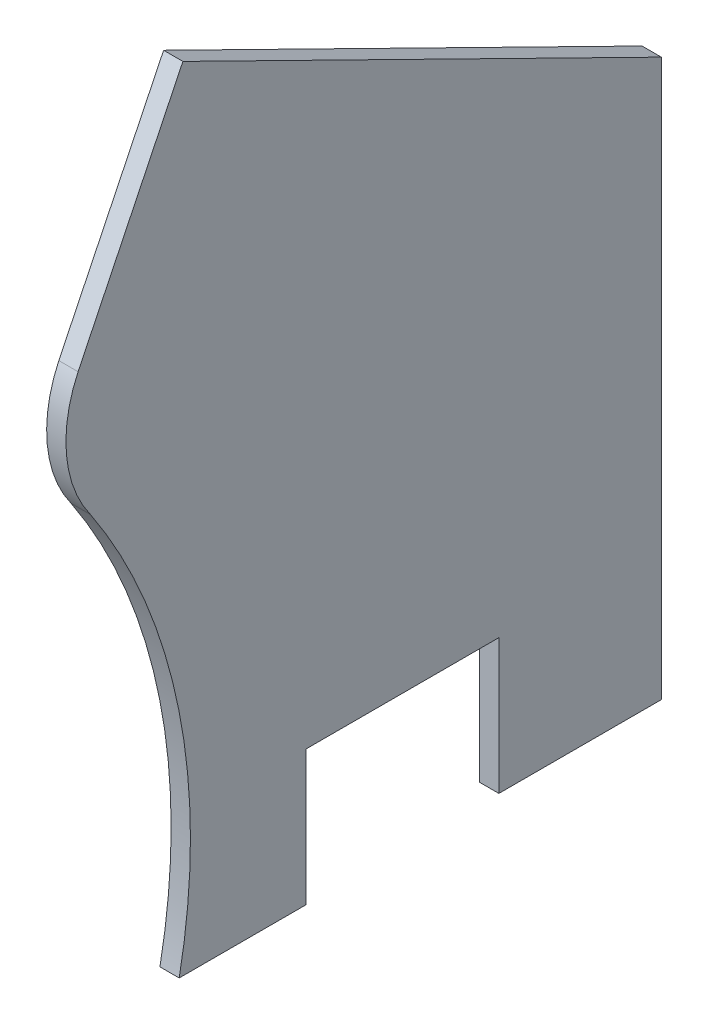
ISO-10303-21;
HEADER;
FILE_DESCRIPTION(('STEP AP214'),'2;1');
FILE_NAME('part.step','',(''),(''),'','','');
FILE_SCHEMA(('AUTOMOTIVE_DESIGN { 1 0 10303 214 1 1 1 1 }'));
ENDSEC;
DATA;
#1=APPLICATION_CONTEXT('core data for automotive mechanical design processes');
#2=APPLICATION_PROTOCOL_DEFINITION('international standard','automotive_design',2000,#1);
#3=PRODUCT_CONTEXT('',#1,'mechanical');
#4=PRODUCT('Part','Part','',(#3));
#5=PRODUCT_RELATED_PRODUCT_CATEGORY('part','',(#4));
#6=PRODUCT_DEFINITION_FORMATION('','',#4);
#7=PRODUCT_DEFINITION_CONTEXT('part definition',#1,'design');
#8=PRODUCT_DEFINITION('design','',#6,#7);
#9=PRODUCT_DEFINITION_SHAPE('','',#8);
#10=(LENGTH_UNIT() NAMED_UNIT(*) SI_UNIT(.MILLI.,.METRE.));
#11=(NAMED_UNIT(*) PLANE_ANGLE_UNIT() SI_UNIT($,.RADIAN.));
#12=(NAMED_UNIT(*) SI_UNIT($,.STERADIAN.) SOLID_ANGLE_UNIT());
#13=UNCERTAINTY_MEASURE_WITH_UNIT(LENGTH_MEASURE(1.E-05),#10,'distance_accuracy_value','');
#14=(GEOMETRIC_REPRESENTATION_CONTEXT(3) GLOBAL_UNCERTAINTY_ASSIGNED_CONTEXT((#13)) GLOBAL_UNIT_ASSIGNED_CONTEXT((#10,
#11,#12)) REPRESENTATION_CONTEXT('',''));
#15=CARTESIAN_POINT('',(0.,0.,0.));
#16=DIRECTION('',(0.,0.,1.));
#17=DIRECTION('',(1.,0.,0.));
#18=AXIS2_PLACEMENT_3D('',#15,#16,#17);
#19=CARTESIAN_POINT('',(10.,-139.724382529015,-310.283640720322));
#20=DIRECTION('',(0.,-0.897183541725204,0.441657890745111));
#21=DIRECTION('',(0.,-0.441657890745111,-0.897183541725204));
#22=AXIS2_PLACEMENT_3D('',#19,#20,#21);
#23=PLANE('',#22);
#24=DIRECTION('',(0.,0.441657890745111,0.897183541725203));
#25=VECTOR('',#24,1.);
#26=CARTESIAN_POINT('',(0.,-139.724382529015,-310.283640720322));
#27=LINE('',#26,#25);
#28=CARTESIAN_POINT('',(0.,-139.724382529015,-310.283640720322));
#29=VERTEX_POINT('',#28);
#30=CARTESIAN_POINT('',(0.,-17.5562832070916,-62.1114460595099));
#31=VERTEX_POINT('',#30);
#32=EDGE_CURVE('E143',#29,#31,#27,.T.);
#33=ORIENTED_EDGE('',*,*,#32,.T.);
#34=DIRECTION('',(-1.,0.,0.));
#35=VECTOR('',#34,1.);
#36=CARTESIAN_POINT('',(10.,-17.5562832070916,-62.1114460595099));
#37=LINE('',#36,#35);
#38=CARTESIAN_POINT('',(10.,-17.5562832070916,-62.1114460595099));
#39=VERTEX_POINT('',#38);
#40=EDGE_CURVE('E11',#39,#31,#37,.T.);
#41=ORIENTED_EDGE('',*,*,#40,.F.);
#42=DIRECTION('',(0.,0.441657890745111,0.897183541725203));
#43=VECTOR('',#42,1.);
#44=CARTESIAN_POINT('',(10.,-139.724382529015,-310.283640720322));
#45=LINE('',#44,#43);
#46=CARTESIAN_POINT('',(10.,-139.724382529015,-310.283640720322));
#47=VERTEX_POINT('',#46);
#48=EDGE_CURVE('E161',#47,#39,#45,.T.);
#49=ORIENTED_EDGE('',*,*,#48,.F.);
#50=DIRECTION('',(-1.,0.,0.));
#51=VECTOR('',#50,1.);
#52=CARTESIAN_POINT('',(10.,-139.724382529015,-310.283640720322));
#53=LINE('',#52,#51);
#54=EDGE_CURVE('E139',#47,#29,#53,.T.);
#55=ORIENTED_EDGE('',*,*,#54,.T.);
#56=EDGE_LOOP('',(#33,#41,#49,#55));
#57=FACE_BOUND('',#56,.T.);
#58=ADVANCED_FACE('F35',(#57),#23,.F.);
#59=CARTESIAN_POINT('',(10.,-17.5562832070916,-62.1114460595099));
#60=DIRECTION('',(0.,-0.4359565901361,-0.899967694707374));
#61=DIRECTION('',(0.,0.899967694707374,-0.4359565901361));
#62=AXIS2_PLACEMENT_3D('',#59,#60,#61);
#63=PLANE('',#62);
#64=DIRECTION('',(0.,-0.899967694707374,0.4359565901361));
#65=VECTOR('',#64,1.);
#66=CARTESIAN_POINT('',(0.,-17.5562832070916,-62.1114460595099));
#67=LINE('',#66,#65);
#68=CARTESIAN_POINT('',(0.,-129.765163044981,-7.75593871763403));
#69=VERTEX_POINT('',#68);
#70=EDGE_CURVE('E146',#31,#69,#67,.T.);
#71=ORIENTED_EDGE('',*,*,#70,.T.);
#72=DIRECTION('',(-1.,0.,0.));
#73=VECTOR('',#72,1.);
#74=CARTESIAN_POINT('',(10.,-129.765163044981,-7.75593871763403));
#75=LINE('',#74,#73);
#76=CARTESIAN_POINT('',(10.,-129.765163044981,-7.75593871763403));
#77=VERTEX_POINT('',#76);
#78=EDGE_CURVE('E43',#77,#69,#75,.T.);
#79=ORIENTED_EDGE('',*,*,#78,.F.);
#80=DIRECTION('',(0.,-0.899967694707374,0.4359565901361));
#81=VECTOR('',#80,1.);
#82=CARTESIAN_POINT('',(10.,-17.5562832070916,-62.1114460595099));
#83=LINE('',#82,#81);
#84=EDGE_CURVE('E100',#39,#77,#83,.T.);
#85=ORIENTED_EDGE('',*,*,#84,.F.);
#86=ORIENTED_EDGE('',*,*,#40,.T.);
#87=EDGE_LOOP('',(#71,#79,#85,#86));
#88=FACE_BOUND('',#87,.T.);
#89=ADVANCED_FACE('F210',(#88),#63,.F.);
#90=CARTESIAN_POINT('',(10.,-158.027923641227,-67.8574100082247));
#91=DIRECTION('',(-1.,0.,0.));
#92=DIRECTION('',(0.,0.,1.));
#93=AXIS2_PLACEMENT_3D('',#90,#91,#92);
#94=CYLINDRICAL_SURFACE('',#93,66.4151374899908);
#95=CARTESIAN_POINT('',(0.,-158.027923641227,-67.8574100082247));
#96=DIRECTION('',(1.,0.,0.));
#97=DIRECTION('',(0.,0.,-1.));
#98=AXIS2_PLACEMENT_3D('',#95,#96,#97);
#99=CIRCLE('',#98,66.4151374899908);
#100=CARTESIAN_POINT('',(0.,-197.130043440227,-14.1731971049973));
#101=VERTEX_POINT('',#100);
#102=EDGE_CURVE('E148',#69,#101,#99,.T.);
#103=ORIENTED_EDGE('',*,*,#102,.T.);
#104=DIRECTION('',(-1.,0.,0.));
#105=VECTOR('',#104,1.);
#106=CARTESIAN_POINT('',(10.,-197.130043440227,-14.1731971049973));
#107=LINE('',#106,#105);
#108=CARTESIAN_POINT('',(10.,-197.130043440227,-14.1731971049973));
#109=VERTEX_POINT('',#108);
#110=EDGE_CURVE('E174',#109,#101,#107,.T.);
#111=ORIENTED_EDGE('',*,*,#110,.F.);
#112=CARTESIAN_POINT('',(10.,-158.027923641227,-67.8574100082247));
#113=DIRECTION('',(1.,0.,0.));
#114=DIRECTION('',(0.,0.,-1.));
#115=AXIS2_PLACEMENT_3D('',#112,#113,#114);
#116=CIRCLE('',#115,66.4151374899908);
#117=EDGE_CURVE('E182',#77,#109,#116,.T.);
#118=ORIENTED_EDGE('',*,*,#117,.F.);
#119=ORIENTED_EDGE('',*,*,#78,.T.);
#120=EDGE_LOOP('',(#103,#111,#118,#119));
#121=FACE_BOUND('',#120,.T.);
#122=ADVANCED_FACE('F180',(#121),#94,.T.);
#123=CARTESIAN_POINT('',(10.,-368.560271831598,243.258575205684));
#124=DIRECTION('',(-1.,0.,0.));
#125=DIRECTION('',(0.,0.,1.));
#126=AXIS2_PLACEMENT_3D('',#123,#124,#125);
#127=CYLINDRICAL_SURFACE('',#126,309.288604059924);
#128=CARTESIAN_POINT('',(0.,-368.560271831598,243.258575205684));
#129=DIRECTION('',(-1.,0.,0.));
#130=DIRECTION('',(0.,0.,-1.));
#131=AXIS2_PLACEMENT_3D('',#128,#129,#130);
#132=CIRCLE('',#131,309.288604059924);
#133=CARTESIAN_POINT('',(0.,-428.321686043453,-60.2014946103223));
#134=VERTEX_POINT('',#133);
#135=EDGE_CURVE('E150',#101,#134,#132,.T.);
#136=ORIENTED_EDGE('',*,*,#135,.T.);
#137=DIRECTION('',(-1.,0.,0.));
#138=VECTOR('',#137,1.);
#139=CARTESIAN_POINT('',(10.,-428.321686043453,-60.2014946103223));
#140=LINE('',#139,#138);
#141=CARTESIAN_POINT('',(10.,-428.321686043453,-60.2014946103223));
#142=VERTEX_POINT('',#141);
#143=EDGE_CURVE('E171',#142,#134,#140,.T.);
#144=ORIENTED_EDGE('',*,*,#143,.F.);
#145=CARTESIAN_POINT('',(10.,-368.560271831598,243.258575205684));
#146=DIRECTION('',(-1.,0.,0.));
#147=DIRECTION('',(0.,0.,-1.));
#148=AXIS2_PLACEMENT_3D('',#145,#146,#147);
#149=CIRCLE('',#148,309.288604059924);
#150=EDGE_CURVE('E200',#109,#142,#149,.T.);
#151=ORIENTED_EDGE('',*,*,#150,.F.);
#152=ORIENTED_EDGE('',*,*,#110,.T.);
#153=EDGE_LOOP('',(#136,#144,#151,#152));
#154=FACE_BOUND('',#153,.T.);
#155=ADVANCED_FACE('F191',(#154),#127,.F.);
#156=CARTESIAN_POINT('',(10.,-428.321686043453,-125.976686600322));
#157=DIRECTION('',(0.,1.,0.));
#158=DIRECTION('',(0.,0.,1.));
#159=AXIS2_PLACEMENT_3D('',#156,#157,#158);
#160=PLANE('',#159);
#161=DIRECTION('',(0.,0.,-1.));
#162=VECTOR('',#161,1.);
#163=CARTESIAN_POINT('',(0.,-428.321686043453,-125.976686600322));
#164=LINE('',#163,#162);
#165=CARTESIAN_POINT('',(0.,-428.321686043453,-125.976686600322));
#166=VERTEX_POINT('',#165);
#167=EDGE_CURVE('E152',#134,#166,#164,.T.);
#168=ORIENTED_EDGE('',*,*,#167,.T.);
#169=DIRECTION('',(-1.,0.,0.));
#170=VECTOR('',#169,1.);
#171=CARTESIAN_POINT('',(10.,-428.321686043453,-125.976686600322));
#172=LINE('',#171,#170);
#173=CARTESIAN_POINT('',(10.,-428.321686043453,-125.976686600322));
#174=VERTEX_POINT('',#173);
#175=EDGE_CURVE('E168',#174,#166,#172,.T.);
#176=ORIENTED_EDGE('',*,*,#175,.F.);
#177=DIRECTION('',(0.,0.,-1.));
#178=VECTOR('',#177,1.);
#179=CARTESIAN_POINT('',(10.,-428.321686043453,-125.976686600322));
#180=LINE('',#179,#178);
#181=EDGE_CURVE('E197',#142,#174,#180,.T.);
#182=ORIENTED_EDGE('',*,*,#181,.F.);
#183=ORIENTED_EDGE('',*,*,#143,.T.);
#184=EDGE_LOOP('',(#168,#176,#182,#183));
#185=FACE_BOUND('',#184,.T.);
#186=ADVANCED_FACE('F195',(#185),#160,.F.);
#187=CARTESIAN_POINT('',(10.,-358.341686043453,-125.976686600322));
#188=DIRECTION('',(0.,0.,1.));
#189=DIRECTION('',(1.,0.,0.));
#190=AXIS2_PLACEMENT_3D('',#187,#188,#189);
#191=PLANE('',#190);
#192=DIRECTION('',(0.,1.,0.));
#193=VECTOR('',#192,1.);
#194=CARTESIAN_POINT('',(0.,-358.341686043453,-125.976686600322));
#195=LINE('',#194,#193);
#196=CARTESIAN_POINT('',(0.,-358.341686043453,-125.976686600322));
#197=VERTEX_POINT('',#196);
#198=EDGE_CURVE('E154',#166,#197,#195,.T.);
#199=ORIENTED_EDGE('',*,*,#198,.T.);
#200=DIRECTION('',(-1.,0.,0.));
#201=VECTOR('',#200,1.);
#202=CARTESIAN_POINT('',(10.,-358.341686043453,-125.976686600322));
#203=LINE('',#202,#201);
#204=CARTESIAN_POINT('',(10.,-358.341686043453,-125.976686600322));
#205=VERTEX_POINT('',#204);
#206=EDGE_CURVE('E165',#205,#197,#203,.T.);
#207=ORIENTED_EDGE('',*,*,#206,.F.);
#208=DIRECTION('',(0.,1.,0.));
#209=VECTOR('',#208,1.);
#210=CARTESIAN_POINT('',(10.,-358.341686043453,-125.976686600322));
#211=LINE('',#210,#209);
#212=EDGE_CURVE('E199',#174,#205,#211,.T.);
#213=ORIENTED_EDGE('',*,*,#212,.F.);
#214=ORIENTED_EDGE('',*,*,#175,.T.);
#215=EDGE_LOOP('',(#199,#207,#213,#214));
#216=FACE_BOUND('',#215,.T.);
#217=ADVANCED_FACE('F222',(#216),#191,.F.);
#218=CARTESIAN_POINT('',(10.,-358.341686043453,-225.996686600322));
#219=DIRECTION('',(0.,1.,0.));
#220=DIRECTION('',(0.,0.,1.));
#221=AXIS2_PLACEMENT_3D('',#218,#219,#220);
#222=PLANE('',#221);
#223=DIRECTION('',(0.,0.,-1.));
#224=VECTOR('',#223,1.);
#225=CARTESIAN_POINT('',(0.,-358.341686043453,-225.996686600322));
#226=LINE('',#225,#224);
#227=CARTESIAN_POINT('',(0.,-358.341686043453,-225.996686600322));
#228=VERTEX_POINT('',#227);
#229=EDGE_CURVE('E156',#197,#228,#226,.T.);
#230=ORIENTED_EDGE('',*,*,#229,.T.);
#231=DIRECTION('',(-1.,0.,0.));
#232=VECTOR('',#231,1.);
#233=CARTESIAN_POINT('',(10.,-358.341686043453,-225.996686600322));
#234=LINE('',#233,#232);
#235=CARTESIAN_POINT('',(10.,-358.341686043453,-225.996686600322));
#236=VERTEX_POINT('',#235);
#237=EDGE_CURVE('E134',#236,#228,#234,.T.);
#238=ORIENTED_EDGE('',*,*,#237,.F.);
#239=DIRECTION('',(0.,0.,-1.));
#240=VECTOR('',#239,1.);
#241=CARTESIAN_POINT('',(10.,-358.341686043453,-225.996686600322));
#242=LINE('',#241,#240);
#243=EDGE_CURVE('E125',#205,#236,#242,.T.);
#244=ORIENTED_EDGE('',*,*,#243,.F.);
#245=ORIENTED_EDGE('',*,*,#206,.T.);
#246=EDGE_LOOP('',(#230,#238,#244,#245));
#247=FACE_BOUND('',#246,.T.);
#248=ADVANCED_FACE('F225',(#247),#222,.F.);
#249=CARTESIAN_POINT('',(10.,-358.341686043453,-225.996686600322));
#250=DIRECTION('',(0.,0.,-1.));
#251=DIRECTION('',(-1.,0.,0.));
#252=AXIS2_PLACEMENT_3D('',#249,#250,#251);
#253=PLANE('',#252);
#254=DIRECTION('',(0.,-1.,0.));
#255=VECTOR('',#254,1.);
#256=CARTESIAN_POINT('',(0.,-358.341686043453,-225.996686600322));
#257=LINE('',#256,#255);
#258=CARTESIAN_POINT('',(0.,-428.321686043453,-225.996686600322));
#259=VERTEX_POINT('',#258);
#260=EDGE_CURVE('E133',#228,#259,#257,.T.);
#261=ORIENTED_EDGE('',*,*,#260,.T.);
#262=DIRECTION('',(-1.,0.,0.));
#263=VECTOR('',#262,1.);
#264=CARTESIAN_POINT('',(10.,-428.321686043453,-225.996686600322));
#265=LINE('',#264,#263);
#266=CARTESIAN_POINT('',(10.,-428.321686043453,-225.996686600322));
#267=VERTEX_POINT('',#266);
#268=EDGE_CURVE('E130',#267,#259,#265,.T.);
#269=ORIENTED_EDGE('',*,*,#268,.F.);
#270=DIRECTION('',(0.,-1.,0.));
#271=VECTOR('',#270,1.);
#272=CARTESIAN_POINT('',(10.,-358.341686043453,-225.996686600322));
#273=LINE('',#272,#271);
#274=EDGE_CURVE('E119',#236,#267,#273,.T.);
#275=ORIENTED_EDGE('',*,*,#274,.F.);
#276=ORIENTED_EDGE('',*,*,#237,.T.);
#277=EDGE_LOOP('',(#261,#269,#275,#276));
#278=FACE_BOUND('',#277,.T.);
#279=ADVANCED_FACE('F131',(#278),#253,.F.);
#280=CARTESIAN_POINT('',(10.,-428.321686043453,-225.996686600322));
#281=DIRECTION('',(0.,1.,0.));
#282=DIRECTION('',(0.,0.,1.));
#283=AXIS2_PLACEMENT_3D('',#280,#281,#282);
#284=PLANE('',#283);
#285=DIRECTION('',(0.,0.,-1.));
#286=VECTOR('',#285,1.);
#287=CARTESIAN_POINT('',(0.,-428.321686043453,-225.996686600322));
#288=LINE('',#287,#286);
#289=CARTESIAN_POINT('',(0.,-428.321686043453,-310.283640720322));
#290=VERTEX_POINT('',#289);
#291=EDGE_CURVE('E86',#259,#290,#288,.T.);
#292=ORIENTED_EDGE('',*,*,#291,.T.);
#293=DIRECTION('',(-1.,0.,0.));
#294=VECTOR('',#293,1.);
#295=CARTESIAN_POINT('',(10.,-428.321686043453,-310.283640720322));
#296=LINE('',#295,#294);
#297=CARTESIAN_POINT('',(10.,-428.321686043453,-310.283640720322));
#298=VERTEX_POINT('',#297);
#299=EDGE_CURVE('E135',#298,#290,#296,.T.);
#300=ORIENTED_EDGE('',*,*,#299,.F.);
#301=DIRECTION('',(0.,0.,-1.));
#302=VECTOR('',#301,1.);
#303=CARTESIAN_POINT('',(10.,-428.321686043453,-225.996686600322));
#304=LINE('',#303,#302);
#305=EDGE_CURVE('E123',#267,#298,#304,.T.);
#306=ORIENTED_EDGE('',*,*,#305,.F.);
#307=ORIENTED_EDGE('',*,*,#268,.T.);
#308=EDGE_LOOP('',(#292,#300,#306,#307));
#309=FACE_BOUND('',#308,.T.);
#310=ADVANCED_FACE('F137',(#309),#284,.F.);
#311=CARTESIAN_POINT('',(10.,-139.724382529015,-310.283640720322));
#312=DIRECTION('',(0.,0.,1.));
#313=DIRECTION('',(0.,-1.,0.));
#314=AXIS2_PLACEMENT_3D('',#311,#312,#313);
#315=PLANE('',#314);
#316=DIRECTION('',(0.,1.,0.));
#317=VECTOR('',#316,1.);
#318=CARTESIAN_POINT('',(0.,-139.724382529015,-310.283640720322));
#319=LINE('',#318,#317);
#320=EDGE_CURVE('E92',#290,#29,#319,.T.);
#321=ORIENTED_EDGE('',*,*,#320,.T.);
#322=ORIENTED_EDGE('',*,*,#54,.F.);
#323=DIRECTION('',(0.,1.,0.));
#324=VECTOR('',#323,1.);
#325=CARTESIAN_POINT('',(10.,-139.724382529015,-310.283640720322));
#326=LINE('',#325,#324);
#327=EDGE_CURVE('E51',#298,#47,#326,.T.);
#328=ORIENTED_EDGE('',*,*,#327,.F.);
#329=ORIENTED_EDGE('',*,*,#299,.T.);
#330=EDGE_LOOP('',(#321,#322,#328,#329));
#331=FACE_BOUND('',#330,.T.);
#332=ADVANCED_FACE('F234',(#331),#315,.F.);
#333=CARTESIAN_POINT('',(10.,-158.027923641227,-67.8574100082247));
#334=DIRECTION('',(1.,0.,0.));
#335=DIRECTION('',(0.,0.,-1.));
#336=AXIS2_PLACEMENT_3D('',#333,#334,#335);
#337=PLANE('',#336);
#338=ORIENTED_EDGE('',*,*,#48,.T.);
#339=ORIENTED_EDGE('',*,*,#84,.T.);
#340=ORIENTED_EDGE('',*,*,#117,.T.);
#341=ORIENTED_EDGE('',*,*,#150,.T.);
#342=ORIENTED_EDGE('',*,*,#181,.T.);
#343=ORIENTED_EDGE('',*,*,#212,.T.);
#344=ORIENTED_EDGE('',*,*,#243,.T.);
#345=ORIENTED_EDGE('',*,*,#274,.T.);
#346=ORIENTED_EDGE('',*,*,#305,.T.);
#347=ORIENTED_EDGE('',*,*,#327,.T.);
#348=EDGE_LOOP('',(#338,#339,#340,#341,#342,#343,#344,#345,#346,#347));
#349=FACE_BOUND('',#348,.T.);
#350=ADVANCED_FACE('F121',(#349),#337,.T.);
#351=CARTESIAN_POINT('',(0.,-158.027923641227,-67.8574100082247));
#352=DIRECTION('',(1.,0.,0.));
#353=DIRECTION('',(0.,0.,-1.));
#354=AXIS2_PLACEMENT_3D('',#351,#352,#353);
#355=PLANE('',#354);
#356=ORIENTED_EDGE('',*,*,#32,.F.);
#357=ORIENTED_EDGE('',*,*,#320,.F.);
#358=ORIENTED_EDGE('',*,*,#291,.F.);
#359=ORIENTED_EDGE('',*,*,#260,.F.);
#360=ORIENTED_EDGE('',*,*,#229,.F.);
#361=ORIENTED_EDGE('',*,*,#198,.F.);
#362=ORIENTED_EDGE('',*,*,#167,.F.);
#363=ORIENTED_EDGE('',*,*,#135,.F.);
#364=ORIENTED_EDGE('',*,*,#102,.F.);
#365=ORIENTED_EDGE('',*,*,#70,.F.);
#366=EDGE_LOOP('',(#356,#357,#358,#359,#360,#361,#362,#363,#364,#365));
#367=FACE_BOUND('',#366,.T.);
#368=ADVANCED_FACE('F186',(#367),#355,.F.);
#369=CLOSED_SHELL('',(#58,#89,#122,#155,#186,#217,#248,#279,#310,#332,#350,#368));
#370=MANIFOLD_SOLID_BREP('B2',#369);
#371=ADVANCED_BREP_SHAPE_REPRESENTATION('',(#18,#370),#14);
#372=SHAPE_DEFINITION_REPRESENTATION(#9,#371);
ENDSEC;
END-ISO-10303-21;
